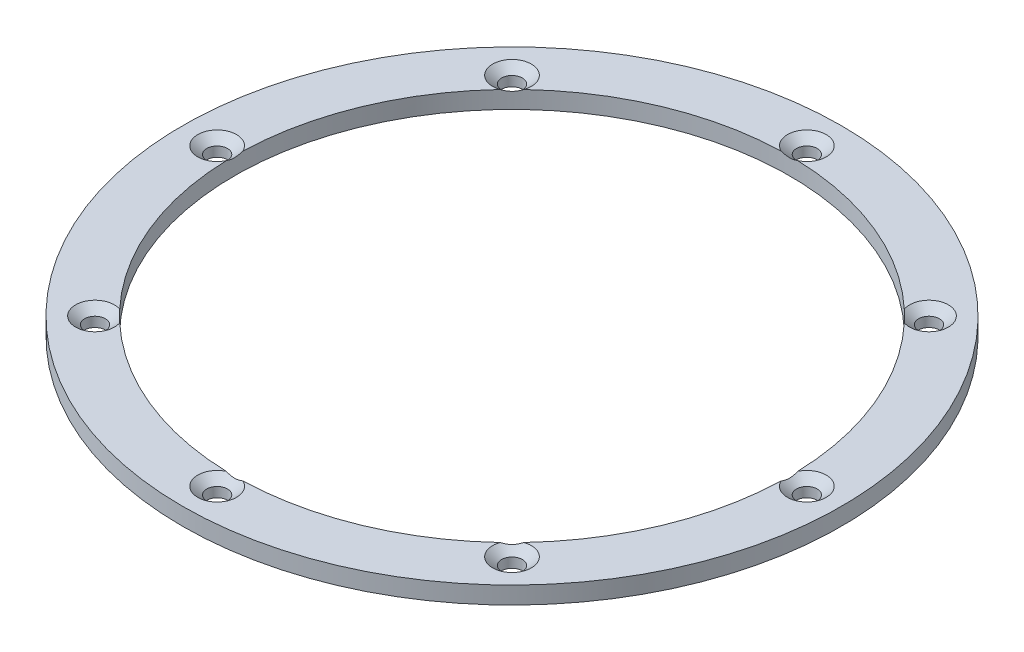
ISO-10303-21;
HEADER;
FILE_DESCRIPTION(('STEP AP214'),'2;1');
FILE_NAME('part.step','',(''),(''),'','','');
FILE_SCHEMA(('AUTOMOTIVE_DESIGN { 1 0 10303 214 1 1 1 1 }'));
ENDSEC;
DATA;
#1=APPLICATION_CONTEXT('core data for automotive mechanical design processes');
#2=APPLICATION_PROTOCOL_DEFINITION('international standard','automotive_design',2000,#1);
#3=PRODUCT_CONTEXT('',#1,'mechanical');
#4=PRODUCT('Part','Part','',(#3));
#5=PRODUCT_RELATED_PRODUCT_CATEGORY('part','',(#4));
#6=PRODUCT_DEFINITION_FORMATION('','',#4);
#7=PRODUCT_DEFINITION_CONTEXT('part definition',#1,'design');
#8=PRODUCT_DEFINITION('design','',#6,#7);
#9=PRODUCT_DEFINITION_SHAPE('','',#8);
#10=(LENGTH_UNIT() NAMED_UNIT(*) SI_UNIT(.MILLI.,.METRE.));
#11=(NAMED_UNIT(*) PLANE_ANGLE_UNIT() SI_UNIT($,.RADIAN.));
#12=(NAMED_UNIT(*) SI_UNIT($,.STERADIAN.) SOLID_ANGLE_UNIT());
#13=UNCERTAINTY_MEASURE_WITH_UNIT(LENGTH_MEASURE(1.E-05),#10,'distance_accuracy_value','');
#14=(GEOMETRIC_REPRESENTATION_CONTEXT(3) GLOBAL_UNCERTAINTY_ASSIGNED_CONTEXT((#13)) GLOBAL_UNIT_ASSIGNED_CONTEXT((#10,
#11,#12)) REPRESENTATION_CONTEXT('',''));
#15=CARTESIAN_POINT('',(0.,0.,0.));
#16=DIRECTION('',(0.,0.,1.));
#17=DIRECTION('',(1.,0.,0.));
#18=AXIS2_PLACEMENT_3D('',#15,#16,#17);
#19=CARTESIAN_POINT('',(0.,3.175,0.));
#20=DIRECTION('',(0.,1.,0.));
#21=DIRECTION('',(0.,0.,1.));
#22=AXIS2_PLACEMENT_3D('',#19,#20,#21);
#23=PLANE('',#22);
#24=CARTESIAN_POINT('',(38.1660885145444,3.175,-38.1660885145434));
#25=DIRECTION('',(0.,1.,0.));
#26=DIRECTION('',(0.,0.,1.));
#27=AXIS2_PLACEMENT_3D('',#24,#25,#26);
#28=CIRCLE('',#27,3.5433);
#29=CARTESIAN_POINT('',(36.9837686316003,3.175,-34.825864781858));
#30=VERTEX_POINT('',#29);
#31=CARTESIAN_POINT('',(34.8258647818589,3.175,-36.9837686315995));
#32=VERTEX_POINT('',#31);
#33=EDGE_CURVE('E59',#30,#32,#28,.T.);
#34=ORIENTED_EDGE('',*,*,#33,.F.);
#35=CARTESIAN_POINT('',(0.,3.175,0.));
#36=DIRECTION('',(0.,1.,0.));
#37=DIRECTION('',(0.,0.,1.));
#38=AXIS2_PLACEMENT_3D('',#35,#36,#37);
#39=CIRCLE('',#38,50.8);
#40=CARTESIAN_POINT('',(50.7770787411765,3.175,-1.52586844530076));
#41=VERTEX_POINT('',#40);
#42=EDGE_CURVE('E117',#41,#30,#39,.T.);
#43=ORIENTED_EDGE('',*,*,#42,.F.);
#44=CARTESIAN_POINT('',(53.975,3.175,0.));
#45=DIRECTION('',(0.,1.,0.));
#46=DIRECTION('',(0.,0.,1.));
#47=AXIS2_PLACEMENT_3D('',#44,#45,#46);
#48=CIRCLE('',#47,3.5433);
#49=CARTESIAN_POINT('',(50.7770787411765,3.175,1.52586844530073));
#50=VERTEX_POINT('',#49);
#51=EDGE_CURVE('E149',#50,#41,#48,.T.);
#52=ORIENTED_EDGE('',*,*,#51,.F.);
#53=CARTESIAN_POINT('',(36.9837686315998,3.175,34.8258647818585));
#54=VERTEX_POINT('',#53);
#55=EDGE_CURVE('E128',#54,#50,#39,.T.);
#56=ORIENTED_EDGE('',*,*,#55,.F.);
#57=CARTESIAN_POINT('',(38.1660885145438,3.175,38.166088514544));
#58=DIRECTION('',(0.,1.,0.));
#59=DIRECTION('',(0.,0.,1.));
#60=AXIS2_PLACEMENT_3D('',#57,#58,#59);
#61=CIRCLE('',#60,3.5433);
#62=CARTESIAN_POINT('',(34.8258647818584,3.175,36.9837686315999));
#63=VERTEX_POINT('',#62);
#64=EDGE_CURVE('E157',#63,#54,#61,.T.);
#65=ORIENTED_EDGE('',*,*,#64,.F.);
#66=CARTESIAN_POINT('',(1.52586844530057,3.175,50.7770787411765));
#67=VERTEX_POINT('',#66);
#68=EDGE_CURVE('E134',#67,#63,#39,.T.);
#69=ORIENTED_EDGE('',*,*,#68,.F.);
#70=CARTESIAN_POINT('',(-1.88452814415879E-13,3.175,53.975));
#71=DIRECTION('',(0.,1.,0.));
#72=DIRECTION('',(0.,0.,1.));
#73=AXIS2_PLACEMENT_3D('',#70,#71,#72);
#74=CIRCLE('',#73,3.5433);
#75=CARTESIAN_POINT('',(-1.52586844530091,3.175,50.7770787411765));
#76=VERTEX_POINT('',#75);
#77=EDGE_CURVE('E165',#76,#67,#74,.T.);
#78=ORIENTED_EDGE('',*,*,#77,.F.);
#79=CARTESIAN_POINT('',(-34.8258647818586,3.175,36.9837686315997));
#80=VERTEX_POINT('',#79);
#81=EDGE_CURVE('E138',#80,#76,#39,.T.);
#82=ORIENTED_EDGE('',*,*,#81,.F.);
#83=CARTESIAN_POINT('',(-38.1660885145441,3.175,38.1660885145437));
#84=DIRECTION('',(0.,1.,0.));
#85=DIRECTION('',(0.,0.,1.));
#86=AXIS2_PLACEMENT_3D('',#83,#84,#85);
#87=CIRCLE('',#86,3.5433);
#88=CARTESIAN_POINT('',(-36.9837686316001,3.175,34.8258647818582));
#89=VERTEX_POINT('',#88);
#90=EDGE_CURVE('E173',#89,#80,#87,.T.);
#91=ORIENTED_EDGE('',*,*,#90,.F.);
#92=CARTESIAN_POINT('',(-50.7770787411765,3.175,1.5258684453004));
#93=VERTEX_POINT('',#92);
#94=EDGE_CURVE('E349',#93,#89,#39,.T.);
#95=ORIENTED_EDGE('',*,*,#94,.F.);
#96=CARTESIAN_POINT('',(-53.975,3.175,-3.76905628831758E-13));
#97=DIRECTION('',(0.,1.,0.));
#98=DIRECTION('',(0.,0.,1.));
#99=AXIS2_PLACEMENT_3D('',#96,#97,#98);
#100=CIRCLE('',#99,3.5433);
#101=CARTESIAN_POINT('',(-50.7770787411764,3.175,-1.52586844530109));
#102=VERTEX_POINT('',#101);
#103=EDGE_CURVE('E181',#102,#93,#100,.T.);
#104=ORIENTED_EDGE('',*,*,#103,.F.);
#105=CARTESIAN_POINT('',(-36.9837686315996,3.175,-34.8258647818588));
#106=VERTEX_POINT('',#105);
#107=EDGE_CURVE('E347',#106,#102,#39,.T.);
#108=ORIENTED_EDGE('',*,*,#107,.F.);
#109=CARTESIAN_POINT('',(-38.1660885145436,3.175,-38.1660885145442));
#110=DIRECTION('',(0.,1.,0.));
#111=DIRECTION('',(0.,0.,1.));
#112=AXIS2_PLACEMENT_3D('',#109,#110,#111);
#113=CIRCLE('',#112,3.5433);
#114=CARTESIAN_POINT('',(-34.8258647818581,3.175,-36.9837686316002));
#115=VERTEX_POINT('',#114);
#116=EDGE_CURVE('E189',#115,#106,#113,.T.);
#117=ORIENTED_EDGE('',*,*,#116,.F.);
#118=CARTESIAN_POINT('',(-1.52586844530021,3.175,-50.7770787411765));
#119=VERTEX_POINT('',#118);
#120=EDGE_CURVE('E132',#119,#115,#39,.T.);
#121=ORIENTED_EDGE('',*,*,#120,.F.);
#122=CARTESIAN_POINT('',(5.65358443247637E-13,3.175,-53.975));
#123=DIRECTION('',(0.,1.,0.));
#124=DIRECTION('',(0.,0.,1.));
#125=AXIS2_PLACEMENT_3D('',#122,#123,#124);
#126=CIRCLE('',#125,3.5433);
#127=CARTESIAN_POINT('',(1.52586844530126,3.175,-50.7770787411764));
#128=VERTEX_POINT('',#127);
#129=EDGE_CURVE('E66',#128,#119,#126,.T.);
#130=ORIENTED_EDGE('',*,*,#129,.F.);
#131=EDGE_CURVE('E118',#32,#128,#39,.T.);
#132=ORIENTED_EDGE('',*,*,#131,.F.);
#133=EDGE_LOOP('',(#34,#43,#52,#56,#65,#69,#78,#82,#91,#95,#104,#108,#117,#121,#130,#132));
#134=FACE_BOUND('',#133,.T.);
#135=CARTESIAN_POINT('',(0.,3.175,0.));
#136=DIRECTION('',(0.,1.,0.));
#137=DIRECTION('',(0.,0.,1.));
#138=AXIS2_PLACEMENT_3D('',#135,#136,#137);
#139=CIRCLE('',#138,60.325);
#140=CARTESIAN_POINT('',(0.,3.175,60.325));
#141=VERTEX_POINT('',#140);
#142=EDGE_CURVE('E130',#141,#141,#139,.T.);
#143=ORIENTED_EDGE('',*,*,#142,.T.);
#144=EDGE_LOOP('',(#143));
#145=FACE_BOUND('',#144,.T.);
#146=ADVANCED_FACE('F41',(#134,#145),#23,.T.);
#147=CARTESIAN_POINT('',(0.,0.,0.));
#148=DIRECTION('',(0.,1.,0.));
#149=DIRECTION('',(0.,0.,1.));
#150=AXIS2_PLACEMENT_3D('',#147,#148,#149);
#151=PLANE('',#150);
#152=CARTESIAN_POINT('',(38.1660885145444,0.,-38.1660885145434));
#153=DIRECTION('',(0.,1.,0.));
#154=DIRECTION('',(0.,0.,1.));
#155=AXIS2_PLACEMENT_3D('',#152,#153,#154);
#156=CIRCLE('',#155,1.89864999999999);
#157=CARTESIAN_POINT('',(38.1660885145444,0.,-36.2674385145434));
#158=VERTEX_POINT('',#157);
#159=EDGE_CURVE('E198',#158,#158,#156,.T.);
#160=ORIENTED_EDGE('',*,*,#159,.T.);
#161=EDGE_LOOP('',(#160));
#162=FACE_BOUND('',#161,.T.);
#163=CARTESIAN_POINT('',(5.65358443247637E-13,0.,-53.975));
#164=DIRECTION('',(0.,1.,0.));
#165=DIRECTION('',(0.,0.,1.));
#166=AXIS2_PLACEMENT_3D('',#163,#164,#165);
#167=CIRCLE('',#166,1.89864999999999);
#168=CARTESIAN_POINT('',(5.65358443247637E-13,0.,-52.07635));
#169=VERTEX_POINT('',#168);
#170=EDGE_CURVE('E191',#169,#169,#167,.T.);
#171=ORIENTED_EDGE('',*,*,#170,.T.);
#172=EDGE_LOOP('',(#171));
#173=FACE_BOUND('',#172,.T.);
#174=CARTESIAN_POINT('',(-38.1660885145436,0.,-38.1660885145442));
#175=DIRECTION('',(0.,1.,0.));
#176=DIRECTION('',(0.,0.,1.));
#177=AXIS2_PLACEMENT_3D('',#174,#175,#176);
#178=CIRCLE('',#177,1.89864999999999);
#179=CARTESIAN_POINT('',(-38.1660885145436,0.,-36.2674385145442));
#180=VERTEX_POINT('',#179);
#181=EDGE_CURVE('E183',#180,#180,#178,.T.);
#182=ORIENTED_EDGE('',*,*,#181,.T.);
#183=EDGE_LOOP('',(#182));
#184=FACE_BOUND('',#183,.T.);
#185=CARTESIAN_POINT('',(-53.975,0.,-3.76905628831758E-13));
#186=DIRECTION('',(0.,1.,0.));
#187=DIRECTION('',(0.,0.,1.));
#188=AXIS2_PLACEMENT_3D('',#185,#186,#187);
#189=CIRCLE('',#188,1.89864999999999);
#190=CARTESIAN_POINT('',(-53.975,0.,1.89864999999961));
#191=VERTEX_POINT('',#190);
#192=EDGE_CURVE('E175',#191,#191,#189,.T.);
#193=ORIENTED_EDGE('',*,*,#192,.T.);
#194=EDGE_LOOP('',(#193));
#195=FACE_BOUND('',#194,.T.);
#196=CARTESIAN_POINT('',(-38.1660885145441,0.,38.1660885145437));
#197=DIRECTION('',(0.,1.,0.));
#198=DIRECTION('',(0.,0.,1.));
#199=AXIS2_PLACEMENT_3D('',#196,#197,#198);
#200=CIRCLE('',#199,1.89864999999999);
#201=CARTESIAN_POINT('',(-38.1660885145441,0.,40.0647385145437));
#202=VERTEX_POINT('',#201);
#203=EDGE_CURVE('E167',#202,#202,#200,.T.);
#204=ORIENTED_EDGE('',*,*,#203,.T.);
#205=EDGE_LOOP('',(#204));
#206=FACE_BOUND('',#205,.T.);
#207=CARTESIAN_POINT('',(-1.88452814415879E-13,0.,53.975));
#208=DIRECTION('',(0.,1.,0.));
#209=DIRECTION('',(0.,0.,1.));
#210=AXIS2_PLACEMENT_3D('',#207,#208,#209);
#211=CIRCLE('',#210,1.89864999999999);
#212=CARTESIAN_POINT('',(-1.88452814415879E-13,0.,55.87365));
#213=VERTEX_POINT('',#212);
#214=EDGE_CURVE('E159',#213,#213,#211,.T.);
#215=ORIENTED_EDGE('',*,*,#214,.T.);
#216=EDGE_LOOP('',(#215));
#217=FACE_BOUND('',#216,.T.);
#218=CARTESIAN_POINT('',(38.1660885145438,0.,38.166088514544));
#219=DIRECTION('',(0.,1.,0.));
#220=DIRECTION('',(0.,0.,1.));
#221=AXIS2_PLACEMENT_3D('',#218,#219,#220);
#222=CIRCLE('',#221,1.89864999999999);
#223=CARTESIAN_POINT('',(38.1660885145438,0.,40.064738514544));
#224=VERTEX_POINT('',#223);
#225=EDGE_CURVE('E151',#224,#224,#222,.T.);
#226=ORIENTED_EDGE('',*,*,#225,.T.);
#227=EDGE_LOOP('',(#226));
#228=FACE_BOUND('',#227,.T.);
#229=CARTESIAN_POINT('',(53.975,0.,0.));
#230=DIRECTION('',(0.,1.,0.));
#231=DIRECTION('',(0.,0.,1.));
#232=AXIS2_PLACEMENT_3D('',#229,#230,#231);
#233=CIRCLE('',#232,1.89864999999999);
#234=CARTESIAN_POINT('',(53.975,0.,1.89864999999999));
#235=VERTEX_POINT('',#234);
#236=EDGE_CURVE('E140',#235,#235,#233,.T.);
#237=ORIENTED_EDGE('',*,*,#236,.T.);
#238=EDGE_LOOP('',(#237));
#239=FACE_BOUND('',#238,.T.);
#240=CARTESIAN_POINT('',(0.,0.,0.));
#241=DIRECTION('',(0.,1.,0.));
#242=DIRECTION('',(0.,0.,1.));
#243=AXIS2_PLACEMENT_3D('',#240,#241,#242);
#244=CIRCLE('',#243,60.325);
#245=CARTESIAN_POINT('',(0.,0.,60.325));
#246=VERTEX_POINT('',#245);
#247=EDGE_CURVE('E126',#246,#246,#244,.T.);
#248=ORIENTED_EDGE('',*,*,#247,.F.);
#249=EDGE_LOOP('',(#248));
#250=FACE_BOUND('',#249,.T.);
#251=CARTESIAN_POINT('',(0.,0.,0.));
#252=DIRECTION('',(0.,1.,0.));
#253=DIRECTION('',(0.,0.,1.));
#254=AXIS2_PLACEMENT_3D('',#251,#252,#253);
#255=CIRCLE('',#254,50.8);
#256=CARTESIAN_POINT('',(0.,0.,50.8));
#257=VERTEX_POINT('',#256);
#258=EDGE_CURVE('E135',#257,#257,#255,.T.);
#259=ORIENTED_EDGE('',*,*,#258,.T.);
#260=EDGE_LOOP('',(#259));
#261=FACE_BOUND('',#260,.T.);
#262=ADVANCED_FACE('F214',(#162,#173,#184,#195,#206,#217,#228,#239,#250,#261),#151,.F.);
#263=CARTESIAN_POINT('',(0.,3.175,0.));
#264=DIRECTION('',(0.,-1.,0.));
#265=DIRECTION('',(0.,0.,-1.));
#266=AXIS2_PLACEMENT_3D('',#263,#264,#265);
#267=CYLINDRICAL_SURFACE('',#266,60.325);
#268=ORIENTED_EDGE('',*,*,#142,.F.);
#269=EDGE_LOOP('',(#268));
#270=FACE_BOUND('',#269,.T.);
#271=ORIENTED_EDGE('',*,*,#247,.T.);
#272=EDGE_LOOP('',(#271));
#273=FACE_BOUND('',#272,.T.);
#274=ADVANCED_FACE('F43',(#270,#273),#267,.T.);
#275=CARTESIAN_POINT('',(0.,3.175,0.));
#276=DIRECTION('',(0.,-1.,0.));
#277=DIRECTION('',(0.,0.,-1.));
#278=AXIS2_PLACEMENT_3D('',#275,#276,#277);
#279=CYLINDRICAL_SURFACE('',#278,50.8);
#280=CARTESIAN_POINT('',(34.8254855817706,3.1752,-36.9841257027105));
#281=CARTESIAN_POINT('',(34.9167718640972,3.12703169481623,-36.8981698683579));
#282=CARTESIAN_POINT('',(35.009034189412,3.08296442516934,-36.8106525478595));
#283=CARTESIAN_POINT('',(35.1954984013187,3.00522393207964,-36.6324111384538));
#284=CARTESIAN_POINT('',(35.2897061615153,2.97158943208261,-36.5416764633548));
#285=CARTESIAN_POINT('',(35.475640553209,2.91836303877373,-36.3611748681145));
#286=CARTESIAN_POINT('',(35.567318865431,2.8982704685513,-36.2715104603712));
#287=CARTESIAN_POINT('',(35.7508389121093,2.87176900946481,-36.0906369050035));
#288=CARTESIAN_POINT('',(35.8426800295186,2.86533484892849,-35.9994309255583));
#289=CARTESIAN_POINT('',(36.0235069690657,2.86666559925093,-35.8184719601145));
#290=CARTESIAN_POINT('',(36.1125099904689,2.87410847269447,-35.728733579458));
#291=CARTESIAN_POINT('',(36.2889830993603,2.9019166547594,-35.5494804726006));
#292=CARTESIAN_POINT('',(36.3764501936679,2.92230482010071,-35.459966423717));
#293=CARTESIAN_POINT('',(36.5524811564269,2.97545634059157,-35.2785025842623));
#294=CARTESIAN_POINT('',(36.6409485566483,3.00868279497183,-35.1865989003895));
#295=CARTESIAN_POINT('',(36.8148062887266,3.08506062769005,-35.0046546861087));
#296=CARTESIAN_POINT('',(36.9002064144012,3.12817641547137,-34.9146087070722));
#297=CARTESIAN_POINT('',(36.9841257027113,3.1752,-34.8254855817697));
#298=B_SPLINE_CURVE_WITH_KNOTS('',3,(#280,#281,#282,#283,#284,#285,#286,#287,#288,#289,#290,
#291,#292,#293,#294,#295,#296,#297),.UNSPECIFIED.,.F.,.F.,(4,2,2,2,2,2,2,2,4),(0.,
0.403178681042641,0.807836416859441,1.19656445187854,1.5845726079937,1.96368832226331,
2.34347528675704,2.73847892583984,3.1320826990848),.UNSPECIFIED.);
#299=EDGE_CURVE('E13',#32,#30,#298,.T.);
#300=ORIENTED_EDGE('',*,*,#299,.F.);
#301=ORIENTED_EDGE('',*,*,#131,.T.);
#302=CARTESIAN_POINT('',(-1.52638906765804,3.1752,-50.7770630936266));
#303=CARTESIAN_POINT('',(-1.40105996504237,3.12703169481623,-50.7808322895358));
#304=CARTESIAN_POINT('',(-1.27393655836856,3.08296442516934,-50.7841875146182));
#305=CARTESIAN_POINT('',(-1.01605074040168,3.00522393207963,-50.7900019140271));
#306=CARTESIAN_POINT('',(-0.885276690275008,2.97158943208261,-50.7924577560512));
#307=CARTESIAN_POINT('',(-0.62616731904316,2.91836303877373,-50.7962993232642));
#308=CARTESIAN_POINT('',(-0.497938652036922,2.8982704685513,-50.7977233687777));
#309=CARTESIAN_POINT('',(-0.240273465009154,2.87176900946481,-50.7995947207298));
#310=CARTESIAN_POINT('',(-0.110839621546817,2.86533484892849,-50.8000438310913));
#311=CARTESIAN_POINT('',(0.144981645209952,2.86666559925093,-50.7999504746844));
#312=CARTESIAN_POINT('',(0.271370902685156,2.87410847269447,-50.7994304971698));
#313=CARTESIAN_POINT('',(0.522907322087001,2.9019166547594,-50.7974647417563));
#314=CARTESIAN_POINT('',(0.64805188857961,2.92230482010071,-50.7960173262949));
#315=CARTESIAN_POINT('',(0.900838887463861,2.97545634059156,-50.792175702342));
#316=CARTESIAN_POINT('',(1.02838050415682,3.00868279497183,-50.78974588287));
#317=CARTESIAN_POINT('',(1.27997047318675,3.08506062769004,-50.7840278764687));
#318=CARTESIAN_POINT('',(1.40402960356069,3.12817641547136,-50.7807427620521));
#319=CARTESIAN_POINT('',(1.5263890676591,3.1752,-50.7770630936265));
#320=B_SPLINE_CURVE_WITH_KNOTS('',3,(#302,#303,#304,#305,#306,#307,#308,#309,#310,#311,#312,
#313,#314,#315,#316,#317,#318,#319),.UNSPECIFIED.,.F.,.F.,(4,2,2,2,2,2,2,2,4),(0.,
0.40317868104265,0.807836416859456,1.19656445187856,1.58457260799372,1.96368832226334,
2.34347528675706,2.73847892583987,3.13208269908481),.UNSPECIFIED.);
#321=EDGE_CURVE('E54',#119,#128,#320,.T.);
#322=ORIENTED_EDGE('',*,*,#321,.F.);
#323=ORIENTED_EDGE('',*,*,#120,.T.);
#324=CARTESIAN_POINT('',(-36.9841257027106,3.1752,-34.8254855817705));
#325=CARTESIAN_POINT('',(-36.8981698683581,3.12703169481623,-34.916771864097));
#326=CARTESIAN_POINT('',(-36.8106525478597,3.08296442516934,-35.0090341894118));
#327=CARTESIAN_POINT('',(-36.632411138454,3.00522393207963,-35.1954984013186));
#328=CARTESIAN_POINT('',(-36.541676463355,2.97158943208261,-35.2897061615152));
#329=CARTESIAN_POINT('',(-36.3611748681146,2.91836303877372,-35.4756405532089));
#330=CARTESIAN_POINT('',(-36.2715104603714,2.8982704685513,-35.5673188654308));
#331=CARTESIAN_POINT('',(-36.0906369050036,2.87176900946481,-35.7508389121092));
#332=CARTESIAN_POINT('',(-35.9994309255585,2.86533484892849,-35.8426800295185));
#333=CARTESIAN_POINT('',(-35.8184719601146,2.86666559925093,-36.0235069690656));
#334=CARTESIAN_POINT('',(-35.7287335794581,2.87410847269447,-36.1125099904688));
#335=CARTESIAN_POINT('',(-35.5494804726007,2.9019166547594,-36.2889830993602));
#336=CARTESIAN_POINT('',(-35.4599664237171,2.92230482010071,-36.3764501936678));
#337=CARTESIAN_POINT('',(-35.2785025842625,2.97545634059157,-36.5524811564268));
#338=CARTESIAN_POINT('',(-35.1865989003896,3.00868279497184,-36.6409485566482));
#339=CARTESIAN_POINT('',(-35.0046546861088,3.08506062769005,-36.8148062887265));
#340=CARTESIAN_POINT('',(-34.9146087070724,3.12817641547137,-36.9002064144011));
#341=CARTESIAN_POINT('',(-34.8254855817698,3.1752,-36.9841257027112));
#342=B_SPLINE_CURVE_WITH_KNOTS('',3,(#324,#325,#326,#327,#328,#329,#330,#331,#332,#333,#334,
#335,#336,#337,#338,#339,#340,#341),.UNSPECIFIED.,.F.,.F.,(4,2,2,2,2,2,2,2,4),(0.,
0.403178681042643,0.807836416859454,1.19656445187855,1.58457260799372,1.96368832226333,
2.34347528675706,2.73847892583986,3.1320826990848),.UNSPECIFIED.);
#343=EDGE_CURVE('E263',#106,#115,#342,.T.);
#344=ORIENTED_EDGE('',*,*,#343,.F.);
#345=ORIENTED_EDGE('',*,*,#107,.T.);
#346=CARTESIAN_POINT('',(-50.7770630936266,3.1752,1.52638906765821));
#347=CARTESIAN_POINT('',(-50.7808322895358,3.12703169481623,1.40105996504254));
#348=CARTESIAN_POINT('',(-50.7841875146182,3.08296442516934,1.27393655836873));
#349=CARTESIAN_POINT('',(-50.7900019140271,3.00522393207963,1.01605074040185));
#350=CARTESIAN_POINT('',(-50.7924577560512,2.97158943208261,0.885276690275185));
#351=CARTESIAN_POINT('',(-50.7962993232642,2.91836303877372,0.62616731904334));
#352=CARTESIAN_POINT('',(-50.7977233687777,2.8982704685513,0.497938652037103));
#353=CARTESIAN_POINT('',(-50.7995947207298,2.87176900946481,0.240273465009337));
#354=CARTESIAN_POINT('',(-50.8000438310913,2.86533484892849,0.110839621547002));
#355=CARTESIAN_POINT('',(-50.7999504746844,2.86666559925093,-0.144981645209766));
#356=CARTESIAN_POINT('',(-50.7994304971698,2.87410847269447,-0.27137090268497));
#357=CARTESIAN_POINT('',(-50.7974647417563,2.9019166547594,-0.522907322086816));
#358=CARTESIAN_POINT('',(-50.7960173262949,2.92230482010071,-0.648051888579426));
#359=CARTESIAN_POINT('',(-50.792175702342,2.97545634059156,-0.900838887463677));
#360=CARTESIAN_POINT('',(-50.78974588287,3.00868279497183,-1.02838050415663));
#361=CARTESIAN_POINT('',(-50.7840278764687,3.08506062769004,-1.27997047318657));
#362=CARTESIAN_POINT('',(-50.7807427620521,3.12817641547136,-1.40402960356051));
#363=CARTESIAN_POINT('',(-50.7770630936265,3.1752,-1.52638906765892));
#364=B_SPLINE_CURVE_WITH_KNOTS('',3,(#346,#347,#348,#349,#350,#351,#352,#353,#354,#355,#356,
#357,#358,#359,#360,#361,#362,#363),.UNSPECIFIED.,.F.,.F.,(4,2,2,2,2,2,2,2,4),(0.,
0.403178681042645,0.807836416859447,1.19656445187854,1.5845726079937,1.96368832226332,
2.34347528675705,2.73847892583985,3.1320826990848),.UNSPECIFIED.);
#365=EDGE_CURVE('E257',#93,#102,#364,.T.);
#366=ORIENTED_EDGE('',*,*,#365,.F.);
#367=ORIENTED_EDGE('',*,*,#94,.T.);
#368=CARTESIAN_POINT('',(-34.8254855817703,3.1752,36.9841257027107));
#369=CARTESIAN_POINT('',(-34.9167718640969,3.12703169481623,36.8981698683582));
#370=CARTESIAN_POINT('',(-35.0090341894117,3.08296442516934,36.8106525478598));
#371=CARTESIAN_POINT('',(-35.1954984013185,3.00522393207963,36.6324111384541));
#372=CARTESIAN_POINT('',(-35.289706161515,2.97158943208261,36.5416764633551));
#373=CARTESIAN_POINT('',(-35.4756405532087,2.91836303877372,36.3611748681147));
#374=CARTESIAN_POINT('',(-35.5673188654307,2.8982704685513,36.2715104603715));
#375=CARTESIAN_POINT('',(-35.7508389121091,2.87176900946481,36.0906369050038));
#376=CARTESIAN_POINT('',(-35.8426800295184,2.86533484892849,35.9994309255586));
#377=CARTESIAN_POINT('',(-36.0235069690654,2.86666559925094,35.8184719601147));
#378=CARTESIAN_POINT('',(-36.1125099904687,2.87410847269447,35.7287335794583));
#379=CARTESIAN_POINT('',(-36.2889830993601,2.9019166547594,35.5494804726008));
#380=CARTESIAN_POINT('',(-36.3764501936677,2.92230482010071,35.4599664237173));
#381=CARTESIAN_POINT('',(-36.5524811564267,2.97545634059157,35.2785025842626));
#382=CARTESIAN_POINT('',(-36.640948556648,3.00868279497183,35.1865989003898));
#383=CARTESIAN_POINT('',(-36.8148062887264,3.08506062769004,35.0046546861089));
#384=CARTESIAN_POINT('',(-36.900206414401,3.12817641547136,34.9146087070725));
#385=CARTESIAN_POINT('',(-36.9841257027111,3.1752,34.8254855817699));
#386=B_SPLINE_CURVE_WITH_KNOTS('',3,(#368,#369,#370,#371,#372,#373,#374,#375,#376,#377,#378,
#379,#380,#381,#382,#383,#384,#385),.UNSPECIFIED.,.F.,.F.,(4,2,2,2,2,2,2,2,4),(0.,
0.403178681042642,0.807836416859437,1.19656445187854,1.5845726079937,1.96368832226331,
2.34347528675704,2.73847892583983,3.13208269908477),.UNSPECIFIED.);
#387=EDGE_CURVE('E250',#80,#89,#386,.T.);
#388=ORIENTED_EDGE('',*,*,#387,.F.);
#389=ORIENTED_EDGE('',*,*,#81,.T.);
#390=CARTESIAN_POINT('',(1.52638906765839,3.1752,50.7770630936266));
#391=CARTESIAN_POINT('',(1.40105996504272,3.12703169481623,50.7808322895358));
#392=CARTESIAN_POINT('',(1.27393655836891,3.08296442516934,50.7841875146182));
#393=CARTESIAN_POINT('',(1.01605074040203,3.00522393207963,50.7900019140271));
#394=CARTESIAN_POINT('',(0.885276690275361,2.97158943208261,50.7924577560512));
#395=CARTESIAN_POINT('',(0.626167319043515,2.91836303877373,50.7962993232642));
#396=CARTESIAN_POINT('',(0.497938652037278,2.8982704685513,50.7977233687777));
#397=CARTESIAN_POINT('',(0.240273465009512,2.87176900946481,50.7995947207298));
#398=CARTESIAN_POINT('',(0.110839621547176,2.86533484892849,50.8000438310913));
#399=CARTESIAN_POINT('',(-0.144981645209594,2.86666559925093,50.7999504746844));
#400=CARTESIAN_POINT('',(-0.271370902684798,2.87410847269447,50.7994304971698));
#401=CARTESIAN_POINT('',(-0.522907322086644,2.9019166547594,50.7974647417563));
#402=CARTESIAN_POINT('',(-0.648051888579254,2.92230482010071,50.7960173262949));
#403=CARTESIAN_POINT('',(-0.900838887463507,2.97545634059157,50.792175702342));
#404=CARTESIAN_POINT('',(-1.02838050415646,3.00868279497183,50.78974588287));
#405=CARTESIAN_POINT('',(-1.2799704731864,3.08506062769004,50.7840278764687));
#406=CARTESIAN_POINT('',(-1.40402960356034,3.12817641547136,50.7807427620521));
#407=CARTESIAN_POINT('',(-1.52638906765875,3.1752,50.7770630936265));
#408=B_SPLINE_CURVE_WITH_KNOTS('',3,(#390,#391,#392,#393,#394,#395,#396,#397,#398,#399,#400,
#401,#402,#403,#404,#405,#406,#407),.UNSPECIFIED.,.F.,.F.,(4,2,2,2,2,2,2,2,4),(0.,
0.403178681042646,0.80783641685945,1.19656445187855,1.58457260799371,1.96368832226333,
2.34347528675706,2.73847892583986,3.13208269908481),.UNSPECIFIED.);
#409=EDGE_CURVE('E243',#67,#76,#408,.T.);
#410=ORIENTED_EDGE('',*,*,#409,.F.);
#411=ORIENTED_EDGE('',*,*,#68,.T.);
#412=CARTESIAN_POINT('',(36.9841257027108,3.1752,34.8254855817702));
#413=CARTESIAN_POINT('',(36.8981698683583,3.12703169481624,34.9167718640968));
#414=CARTESIAN_POINT('',(36.8106525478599,3.08296442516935,35.0090341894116));
#415=CARTESIAN_POINT('',(36.6324111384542,3.00522393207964,35.1954984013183));
#416=CARTESIAN_POINT('',(36.5416764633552,2.97158943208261,35.2897061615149));
#417=CARTESIAN_POINT('',(36.3611748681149,2.91836303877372,35.4756405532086));
#418=CARTESIAN_POINT('',(36.2715104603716,2.8982704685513,35.5673188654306));
#419=CARTESIAN_POINT('',(36.0906369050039,2.87176900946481,35.7508389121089));
#420=CARTESIAN_POINT('',(35.9994309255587,2.86533484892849,35.8426800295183));
#421=CARTESIAN_POINT('',(35.8184719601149,2.86666559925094,36.0235069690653));
#422=CARTESIAN_POINT('',(35.7287335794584,2.87410847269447,36.1125099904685));
#423=CARTESIAN_POINT('',(35.549480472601,2.9019166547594,36.28898309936));
#424=CARTESIAN_POINT('',(35.4599664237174,2.92230482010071,36.3764501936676));
#425=CARTESIAN_POINT('',(35.2785025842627,2.97545634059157,36.5524811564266));
#426=CARTESIAN_POINT('',(35.1865989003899,3.00868279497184,36.6409485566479));
#427=CARTESIAN_POINT('',(35.0046546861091,3.08506062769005,36.8148062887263));
#428=CARTESIAN_POINT('',(34.9146087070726,3.12817641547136,36.9002064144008));
#429=CARTESIAN_POINT('',(34.8254855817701,3.1752,36.984125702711));
#430=B_SPLINE_CURVE_WITH_KNOTS('',3,(#412,#413,#414,#415,#416,#417,#418,#419,#420,#421,#422,
#423,#424,#425,#426,#427,#428,#429),.UNSPECIFIED.,.F.,.F.,(4,2,2,2,2,2,2,2,4),(0.,
0.403178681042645,0.807836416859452,1.19656445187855,1.58457260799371,1.96368832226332,
2.34347528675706,2.73847892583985,3.13208269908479),.UNSPECIFIED.);
#431=EDGE_CURVE('E236',#54,#63,#430,.T.);
#432=ORIENTED_EDGE('',*,*,#431,.F.);
#433=ORIENTED_EDGE('',*,*,#55,.T.);
#434=CARTESIAN_POINT('',(50.7770630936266,3.1752,-1.52638906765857));
#435=CARTESIAN_POINT('',(50.7808322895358,3.12703169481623,-1.40105996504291));
#436=CARTESIAN_POINT('',(50.7841875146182,3.08296442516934,-1.27393655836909));
#437=CARTESIAN_POINT('',(50.7900019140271,3.00522393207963,-1.01605074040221));
#438=CARTESIAN_POINT('',(50.7924577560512,2.97158943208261,-0.885276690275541));
#439=CARTESIAN_POINT('',(50.7962993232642,2.91836303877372,-0.626167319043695));
#440=CARTESIAN_POINT('',(50.7977233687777,2.8982704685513,-0.497938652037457));
#441=CARTESIAN_POINT('',(50.7995947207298,2.87176900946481,-0.240273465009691));
#442=CARTESIAN_POINT('',(50.8000438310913,2.86533484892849,-0.110839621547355));
#443=CARTESIAN_POINT('',(50.7999504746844,2.86666559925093,0.144981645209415));
#444=CARTESIAN_POINT('',(50.7994304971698,2.87410847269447,0.271370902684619));
#445=CARTESIAN_POINT('',(50.7974647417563,2.9019166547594,0.522907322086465));
#446=CARTESIAN_POINT('',(50.7960173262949,2.92230482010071,0.648051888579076));
#447=CARTESIAN_POINT('',(50.792175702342,2.97545634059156,0.900838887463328));
#448=CARTESIAN_POINT('',(50.78974588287,3.00868279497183,1.02838050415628));
#449=CARTESIAN_POINT('',(50.7840278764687,3.08506062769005,1.27997047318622));
#450=CARTESIAN_POINT('',(50.7807427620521,3.12817641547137,1.40402960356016));
#451=CARTESIAN_POINT('',(50.7770630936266,3.1752,1.52638906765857));
#452=B_SPLINE_CURVE_WITH_KNOTS('',3,(#434,#435,#436,#437,#438,#439,#440,#441,#442,#443,#444,
#445,#446,#447,#448,#449,#450,#451),.UNSPECIFIED.,.F.,.F.,(4,2,2,2,2,2,2,2,4),(0.,
0.403178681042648,0.807836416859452,1.19656445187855,1.58457260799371,1.96368832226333,
2.34347528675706,2.73847892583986,3.13208269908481),.UNSPECIFIED.);
#453=EDGE_CURVE('E125',#41,#50,#452,.T.);
#454=ORIENTED_EDGE('',*,*,#453,.F.);
#455=ORIENTED_EDGE('',*,*,#42,.T.);
#456=EDGE_LOOP('',(#300,#301,#322,#323,#344,#345,#366,#367,#388,#389,#410,#411,#432,#433,#454,#455));
#457=FACE_BOUND('',#456,.T.);
#458=ORIENTED_EDGE('',*,*,#258,.F.);
#459=EDGE_LOOP('',(#458));
#460=FACE_BOUND('',#459,.T.);
#461=ADVANCED_FACE('F122',(#457,#460),#279,.F.);
#462=CARTESIAN_POINT('',(53.975,3.175,0.));
#463=DIRECTION('',(0.,1.,0.));
#464=DIRECTION('',(0.,0.,1.));
#465=AXIS2_PLACEMENT_3D('',#462,#463,#464);
#466=CYLINDRICAL_SURFACE('',#465,1.89864999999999);
#467=ORIENTED_EDGE('',*,*,#236,.F.);
#468=EDGE_LOOP('',(#467));
#469=FACE_BOUND('',#468,.T.);
#470=CARTESIAN_POINT('',(53.975,1.79497479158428,0.));
#471=DIRECTION('',(0.,1.,0.));
#472=DIRECTION('',(0.,0.,1.));
#473=AXIS2_PLACEMENT_3D('',#470,#471,#472);
#474=CIRCLE('',#473,1.89865);
#475=CARTESIAN_POINT('',(53.975,1.79497479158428,1.89865));
#476=VERTEX_POINT('',#475);
#477=EDGE_CURVE('E144',#476,#476,#474,.T.);
#478=ORIENTED_EDGE('',*,*,#477,.T.);
#479=EDGE_LOOP('',(#478));
#480=FACE_BOUND('',#479,.T.);
#481=ADVANCED_FACE('F224',(#469,#480),#466,.F.);
#482=CARTESIAN_POINT('',(53.975,3.175,0.));
#483=DIRECTION('',(0.,1.,0.));
#484=DIRECTION('',(0.,0.,1.));
#485=AXIS2_PLACEMENT_3D('',#482,#483,#484);
#486=CONICAL_SURFACE('',#485,3.5433,0.872664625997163);
#487=ORIENTED_EDGE('',*,*,#453,.T.);
#488=ORIENTED_EDGE('',*,*,#51,.T.);
#489=EDGE_LOOP('',(#487,#488));
#490=FACE_BOUND('',#489,.T.);
#491=ORIENTED_EDGE('',*,*,#477,.F.);
#492=EDGE_LOOP('',(#491));
#493=FACE_BOUND('',#492,.T.);
#494=ADVANCED_FACE('F317',(#490,#493),#486,.F.);
#495=CARTESIAN_POINT('',(38.1660885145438,3.175,38.166088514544));
#496=DIRECTION('',(0.,1.,0.));
#497=DIRECTION('',(0.,0.,1.));
#498=AXIS2_PLACEMENT_3D('',#495,#496,#497);
#499=CYLINDRICAL_SURFACE('',#498,1.89864999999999);
#500=ORIENTED_EDGE('',*,*,#225,.F.);
#501=EDGE_LOOP('',(#500));
#502=FACE_BOUND('',#501,.T.);
#503=CARTESIAN_POINT('',(38.1660885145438,1.79497479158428,38.166088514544));
#504=DIRECTION('',(0.,1.,0.));
#505=DIRECTION('',(0.,0.,1.));
#506=AXIS2_PLACEMENT_3D('',#503,#504,#505);
#507=CIRCLE('',#506,1.89865);
#508=CARTESIAN_POINT('',(38.1660885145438,1.79497479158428,40.064738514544));
#509=VERTEX_POINT('',#508);
#510=EDGE_CURVE('E154',#509,#509,#507,.T.);
#511=ORIENTED_EDGE('',*,*,#510,.T.);
#512=EDGE_LOOP('',(#511));
#513=FACE_BOUND('',#512,.T.);
#514=ADVANCED_FACE('F314',(#502,#513),#499,.F.);
#515=CARTESIAN_POINT('',(38.1660885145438,3.175,38.166088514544));
#516=DIRECTION('',(0.,1.,0.));
#517=DIRECTION('',(0.,0.,1.));
#518=AXIS2_PLACEMENT_3D('',#515,#516,#517);
#519=CONICAL_SURFACE('',#518,3.5433,0.872664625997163);
#520=ORIENTED_EDGE('',*,*,#431,.T.);
#521=ORIENTED_EDGE('',*,*,#64,.T.);
#522=EDGE_LOOP('',(#520,#521));
#523=FACE_BOUND('',#522,.T.);
#524=ORIENTED_EDGE('',*,*,#510,.F.);
#525=EDGE_LOOP('',(#524));
#526=FACE_BOUND('',#525,.T.);
#527=ADVANCED_FACE('F309',(#523,#526),#519,.F.);
#528=CARTESIAN_POINT('',(-1.88452814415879E-13,3.175,53.975));
#529=DIRECTION('',(0.,1.,0.));
#530=DIRECTION('',(0.,0.,1.));
#531=AXIS2_PLACEMENT_3D('',#528,#529,#530);
#532=CYLINDRICAL_SURFACE('',#531,1.89864999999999);
#533=ORIENTED_EDGE('',*,*,#214,.F.);
#534=EDGE_LOOP('',(#533));
#535=FACE_BOUND('',#534,.T.);
#536=CARTESIAN_POINT('',(-1.88452814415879E-13,1.79497479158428,53.975));
#537=DIRECTION('',(0.,1.,0.));
#538=DIRECTION('',(0.,0.,1.));
#539=AXIS2_PLACEMENT_3D('',#536,#537,#538);
#540=CIRCLE('',#539,1.89865);
#541=CARTESIAN_POINT('',(-1.88452814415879E-13,1.79497479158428,55.87365));
#542=VERTEX_POINT('',#541);
#543=EDGE_CURVE('E162',#542,#542,#540,.T.);
#544=ORIENTED_EDGE('',*,*,#543,.T.);
#545=EDGE_LOOP('',(#544));
#546=FACE_BOUND('',#545,.T.);
#547=ADVANCED_FACE('F306',(#535,#546),#532,.F.);
#548=CARTESIAN_POINT('',(-1.88452814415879E-13,3.175,53.975));
#549=DIRECTION('',(0.,1.,0.));
#550=DIRECTION('',(0.,0.,1.));
#551=AXIS2_PLACEMENT_3D('',#548,#549,#550);
#552=CONICAL_SURFACE('',#551,3.5433,0.872664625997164);
#553=ORIENTED_EDGE('',*,*,#409,.T.);
#554=ORIENTED_EDGE('',*,*,#77,.T.);
#555=EDGE_LOOP('',(#553,#554));
#556=FACE_BOUND('',#555,.T.);
#557=ORIENTED_EDGE('',*,*,#543,.F.);
#558=EDGE_LOOP('',(#557));
#559=FACE_BOUND('',#558,.T.);
#560=ADVANCED_FACE('F301',(#556,#559),#552,.F.);
#561=CARTESIAN_POINT('',(-38.1660885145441,3.175,38.1660885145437));
#562=DIRECTION('',(0.,1.,0.));
#563=DIRECTION('',(0.,0.,1.));
#564=AXIS2_PLACEMENT_3D('',#561,#562,#563);
#565=CYLINDRICAL_SURFACE('',#564,1.89864999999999);
#566=ORIENTED_EDGE('',*,*,#203,.F.);
#567=EDGE_LOOP('',(#566));
#568=FACE_BOUND('',#567,.T.);
#569=CARTESIAN_POINT('',(-38.1660885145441,1.79497479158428,38.1660885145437));
#570=DIRECTION('',(0.,1.,0.));
#571=DIRECTION('',(0.,0.,1.));
#572=AXIS2_PLACEMENT_3D('',#569,#570,#571);
#573=CIRCLE('',#572,1.89865);
#574=CARTESIAN_POINT('',(-38.1660885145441,1.79497479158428,40.0647385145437));
#575=VERTEX_POINT('',#574);
#576=EDGE_CURVE('E170',#575,#575,#573,.T.);
#577=ORIENTED_EDGE('',*,*,#576,.T.);
#578=EDGE_LOOP('',(#577));
#579=FACE_BOUND('',#578,.T.);
#580=ADVANCED_FACE('F298',(#568,#579),#565,.F.);
#581=CARTESIAN_POINT('',(-38.1660885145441,3.175,38.1660885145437));
#582=DIRECTION('',(0.,1.,0.));
#583=DIRECTION('',(0.,0.,1.));
#584=AXIS2_PLACEMENT_3D('',#581,#582,#583);
#585=CONICAL_SURFACE('',#584,3.5433,0.872664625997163);
#586=ORIENTED_EDGE('',*,*,#387,.T.);
#587=ORIENTED_EDGE('',*,*,#90,.T.);
#588=EDGE_LOOP('',(#586,#587));
#589=FACE_BOUND('',#588,.T.);
#590=ORIENTED_EDGE('',*,*,#576,.F.);
#591=EDGE_LOOP('',(#590));
#592=FACE_BOUND('',#591,.T.);
#593=ADVANCED_FACE('F293',(#589,#592),#585,.F.);
#594=CARTESIAN_POINT('',(-53.975,3.175,-3.76905628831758E-13));
#595=DIRECTION('',(0.,1.,0.));
#596=DIRECTION('',(0.,0.,1.));
#597=AXIS2_PLACEMENT_3D('',#594,#595,#596);
#598=CYLINDRICAL_SURFACE('',#597,1.89864999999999);
#599=ORIENTED_EDGE('',*,*,#192,.F.);
#600=EDGE_LOOP('',(#599));
#601=FACE_BOUND('',#600,.T.);
#602=CARTESIAN_POINT('',(-53.975,1.79497479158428,-3.76905628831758E-13));
#603=DIRECTION('',(0.,1.,0.));
#604=DIRECTION('',(0.,0.,1.));
#605=AXIS2_PLACEMENT_3D('',#602,#603,#604);
#606=CIRCLE('',#605,1.89865);
#607=CARTESIAN_POINT('',(-53.975,1.79497479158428,1.89864999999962));
#608=VERTEX_POINT('',#607);
#609=EDGE_CURVE('E178',#608,#608,#606,.T.);
#610=ORIENTED_EDGE('',*,*,#609,.T.);
#611=EDGE_LOOP('',(#610));
#612=FACE_BOUND('',#611,.T.);
#613=ADVANCED_FACE('F290',(#601,#612),#598,.F.);
#614=CARTESIAN_POINT('',(-53.975,3.175,-3.76905628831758E-13));
#615=DIRECTION('',(0.,1.,0.));
#616=DIRECTION('',(0.,0.,1.));
#617=AXIS2_PLACEMENT_3D('',#614,#615,#616);
#618=CONICAL_SURFACE('',#617,3.5433,0.872664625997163);
#619=ORIENTED_EDGE('',*,*,#365,.T.);
#620=ORIENTED_EDGE('',*,*,#103,.T.);
#621=EDGE_LOOP('',(#619,#620));
#622=FACE_BOUND('',#621,.T.);
#623=ORIENTED_EDGE('',*,*,#609,.F.);
#624=EDGE_LOOP('',(#623));
#625=FACE_BOUND('',#624,.T.);
#626=ADVANCED_FACE('F285',(#622,#625),#618,.F.);
#627=CARTESIAN_POINT('',(-38.1660885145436,3.175,-38.1660885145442));
#628=DIRECTION('',(0.,1.,0.));
#629=DIRECTION('',(0.,0.,1.));
#630=AXIS2_PLACEMENT_3D('',#627,#628,#629);
#631=CYLINDRICAL_SURFACE('',#630,1.89864999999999);
#632=ORIENTED_EDGE('',*,*,#181,.F.);
#633=EDGE_LOOP('',(#632));
#634=FACE_BOUND('',#633,.T.);
#635=CARTESIAN_POINT('',(-38.1660885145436,1.79497479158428,-38.1660885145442));
#636=DIRECTION('',(0.,1.,0.));
#637=DIRECTION('',(0.,0.,1.));
#638=AXIS2_PLACEMENT_3D('',#635,#636,#637);
#639=CIRCLE('',#638,1.89865);
#640=CARTESIAN_POINT('',(-38.1660885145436,1.79497479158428,-36.2674385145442));
#641=VERTEX_POINT('',#640);
#642=EDGE_CURVE('E186',#641,#641,#639,.T.);
#643=ORIENTED_EDGE('',*,*,#642,.T.);
#644=EDGE_LOOP('',(#643));
#645=FACE_BOUND('',#644,.T.);
#646=ADVANCED_FACE('F282',(#634,#645),#631,.F.);
#647=CARTESIAN_POINT('',(-38.1660885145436,3.175,-38.1660885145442));
#648=DIRECTION('',(0.,1.,0.));
#649=DIRECTION('',(0.,0.,1.));
#650=AXIS2_PLACEMENT_3D('',#647,#648,#649);
#651=CONICAL_SURFACE('',#650,3.5433,0.872664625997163);
#652=ORIENTED_EDGE('',*,*,#343,.T.);
#653=ORIENTED_EDGE('',*,*,#116,.T.);
#654=EDGE_LOOP('',(#652,#653));
#655=FACE_BOUND('',#654,.T.);
#656=ORIENTED_EDGE('',*,*,#642,.F.);
#657=EDGE_LOOP('',(#656));
#658=FACE_BOUND('',#657,.T.);
#659=ADVANCED_FACE('F277',(#655,#658),#651,.F.);
#660=CARTESIAN_POINT('',(5.65358443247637E-13,3.175,-53.975));
#661=DIRECTION('',(0.,1.,0.));
#662=DIRECTION('',(0.,0.,1.));
#663=AXIS2_PLACEMENT_3D('',#660,#661,#662);
#664=CYLINDRICAL_SURFACE('',#663,1.89864999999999);
#665=ORIENTED_EDGE('',*,*,#170,.F.);
#666=EDGE_LOOP('',(#665));
#667=FACE_BOUND('',#666,.T.);
#668=CARTESIAN_POINT('',(5.65358443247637E-13,1.79497479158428,-53.975));
#669=DIRECTION('',(0.,1.,0.));
#670=DIRECTION('',(0.,0.,1.));
#671=AXIS2_PLACEMENT_3D('',#668,#669,#670);
#672=CIRCLE('',#671,1.89865);
#673=CARTESIAN_POINT('',(5.65358443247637E-13,1.79497479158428,-52.07635));
#674=VERTEX_POINT('',#673);
#675=EDGE_CURVE('E194',#674,#674,#672,.T.);
#676=ORIENTED_EDGE('',*,*,#675,.T.);
#677=EDGE_LOOP('',(#676));
#678=FACE_BOUND('',#677,.T.);
#679=ADVANCED_FACE('F275',(#667,#678),#664,.F.);
#680=CARTESIAN_POINT('',(5.65358443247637E-13,3.175,-53.975));
#681=DIRECTION('',(0.,1.,0.));
#682=DIRECTION('',(0.,0.,1.));
#683=AXIS2_PLACEMENT_3D('',#680,#681,#682);
#684=CONICAL_SURFACE('',#683,3.5433,0.872664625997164);
#685=ORIENTED_EDGE('',*,*,#321,.T.);
#686=ORIENTED_EDGE('',*,*,#129,.T.);
#687=EDGE_LOOP('',(#685,#686));
#688=FACE_BOUND('',#687,.T.);
#689=ORIENTED_EDGE('',*,*,#675,.F.);
#690=EDGE_LOOP('',(#689));
#691=FACE_BOUND('',#690,.T.);
#692=ADVANCED_FACE('F209',(#688,#691),#684,.F.);
#693=CARTESIAN_POINT('',(38.1660885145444,3.175,-38.1660885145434));
#694=DIRECTION('',(0.,1.,0.));
#695=DIRECTION('',(0.,0.,1.));
#696=AXIS2_PLACEMENT_3D('',#693,#694,#695);
#697=CYLINDRICAL_SURFACE('',#696,1.89864999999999);
#698=ORIENTED_EDGE('',*,*,#159,.F.);
#699=EDGE_LOOP('',(#698));
#700=FACE_BOUND('',#699,.T.);
#701=CARTESIAN_POINT('',(38.1660885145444,1.79497479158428,-38.1660885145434));
#702=DIRECTION('',(0.,1.,0.));
#703=DIRECTION('',(0.,0.,1.));
#704=AXIS2_PLACEMENT_3D('',#701,#702,#703);
#705=CIRCLE('',#704,1.89865);
#706=CARTESIAN_POINT('',(38.1660885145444,1.79497479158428,-36.2674385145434));
#707=VERTEX_POINT('',#706);
#708=EDGE_CURVE('E119',#707,#707,#705,.T.);
#709=ORIENTED_EDGE('',*,*,#708,.T.);
#710=EDGE_LOOP('',(#709));
#711=FACE_BOUND('',#710,.T.);
#712=ADVANCED_FACE('F204',(#700,#711),#697,.F.);
#713=CARTESIAN_POINT('',(38.1660885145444,3.175,-38.1660885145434));
#714=DIRECTION('',(0.,1.,0.));
#715=DIRECTION('',(0.,0.,1.));
#716=AXIS2_PLACEMENT_3D('',#713,#714,#715);
#717=CONICAL_SURFACE('',#716,3.5433,0.872664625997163);
#718=ORIENTED_EDGE('',*,*,#299,.T.);
#719=ORIENTED_EDGE('',*,*,#33,.T.);
#720=EDGE_LOOP('',(#718,#719));
#721=FACE_BOUND('',#720,.T.);
#722=ORIENTED_EDGE('',*,*,#708,.F.);
#723=EDGE_LOOP('',(#722));
#724=FACE_BOUND('',#723,.T.);
#725=ADVANCED_FACE('F108',(#721,#724),#717,.F.);
#726=CLOSED_SHELL('',(#146,#262,#274,#461,#481,#494,#514,#527,#547,#560,#580,#593,#613,#626,
#646,#659,#679,#692,#712,#725));
#727=MANIFOLD_SOLID_BREP('B2',#726);
#728=ADVANCED_BREP_SHAPE_REPRESENTATION('',(#18,#727),#14);
#729=SHAPE_DEFINITION_REPRESENTATION(#9,#728);
ENDSEC;
END-ISO-10303-21;
